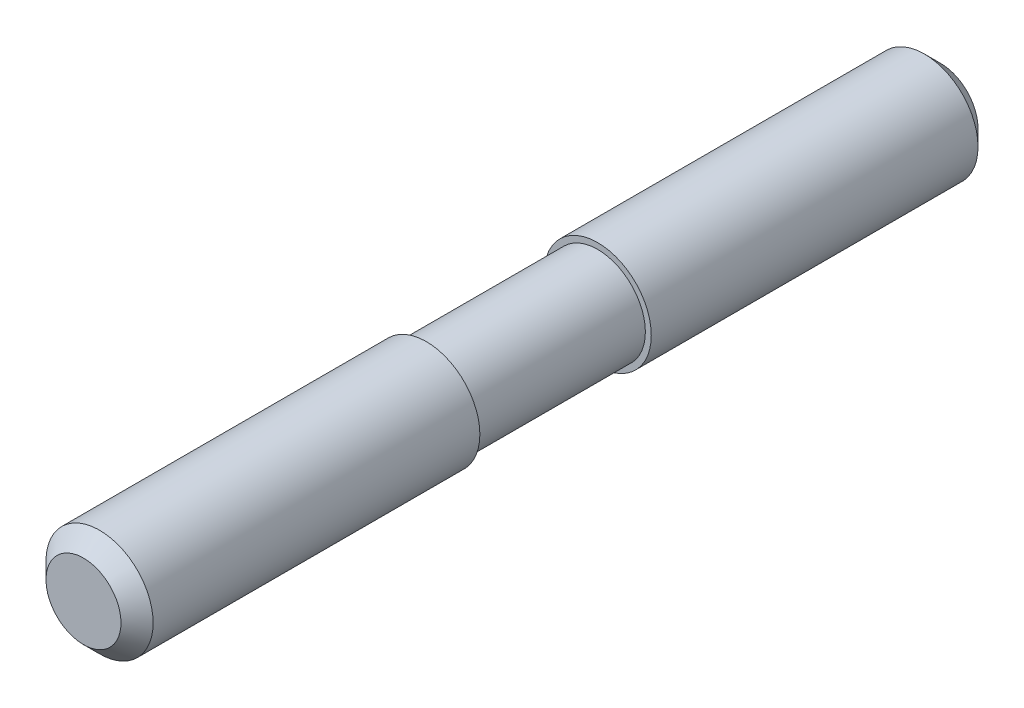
ISO-10303-21;
HEADER;
FILE_DESCRIPTION(('STEP AP214'),'2;1');
FILE_NAME('part.step','',(''),(''),'','','');
FILE_SCHEMA(('AUTOMOTIVE_DESIGN { 1 0 10303 214 1 1 1 1 }'));
ENDSEC;
DATA;
#1=APPLICATION_CONTEXT('core data for automotive mechanical design processes');
#2=APPLICATION_PROTOCOL_DEFINITION('international standard','automotive_design',2000,#1);
#3=PRODUCT_CONTEXT('',#1,'mechanical');
#4=PRODUCT('Part','Part','',(#3));
#5=PRODUCT_RELATED_PRODUCT_CATEGORY('part','',(#4));
#6=PRODUCT_DEFINITION_FORMATION('','',#4);
#7=PRODUCT_DEFINITION_CONTEXT('part definition',#1,'design');
#8=PRODUCT_DEFINITION('design','',#6,#7);
#9=PRODUCT_DEFINITION_SHAPE('','',#8);
#10=(LENGTH_UNIT() NAMED_UNIT(*) SI_UNIT(.MILLI.,.METRE.));
#11=(NAMED_UNIT(*) PLANE_ANGLE_UNIT() SI_UNIT($,.RADIAN.));
#12=(NAMED_UNIT(*) SI_UNIT($,.STERADIAN.) SOLID_ANGLE_UNIT());
#13=UNCERTAINTY_MEASURE_WITH_UNIT(LENGTH_MEASURE(1.E-05),#10,'distance_accuracy_value','');
#14=(GEOMETRIC_REPRESENTATION_CONTEXT(3) GLOBAL_UNCERTAINTY_ASSIGNED_CONTEXT((#13)) GLOBAL_UNIT_ASSIGNED_CONTEXT((#10,
#11,#12)) REPRESENTATION_CONTEXT('',''));
#15=CARTESIAN_POINT('',(0.,0.,0.));
#16=DIRECTION('',(0.,0.,1.));
#17=DIRECTION('',(1.,0.,0.));
#18=AXIS2_PLACEMENT_3D('',#15,#16,#17);
#19=CARTESIAN_POINT('',(0.,0.,0.));
#20=DIRECTION('',(0.,0.,1.));
#21=DIRECTION('',(1.,0.,0.));
#22=AXIS2_PLACEMENT_3D('',#19,#20,#21);
#23=PLANE('',#22);
#24=CARTESIAN_POINT('',(0.,0.,0.));
#25=DIRECTION('',(0.,0.,1.));
#26=DIRECTION('',(1.,0.,0.));
#27=AXIS2_PLACEMENT_3D('',#24,#25,#26);
#28=CIRCLE('',#27,3.5);
#29=CARTESIAN_POINT('',(3.5,0.,0.));
#30=VERTEX_POINT('',#29);
#31=EDGE_CURVE('E8',#30,#30,#28,.T.);
#32=ORIENTED_EDGE('',*,*,#31,.F.);
#33=EDGE_LOOP('',(#32));
#34=FACE_BOUND('',#33,.T.);
#35=ADVANCED_FACE('F12',(#34),#23,.F.);
#36=CARTESIAN_POINT('',(0.,0.,1.5));
#37=DIRECTION('',(0.,0.,1.));
#38=DIRECTION('',(1.,0.,0.));
#39=AXIS2_PLACEMENT_3D('',#36,#37,#38);
#40=CONICAL_SURFACE('',#39,5.,0.785398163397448);
#41=ORIENTED_EDGE('',*,*,#31,.T.);
#42=EDGE_LOOP('',(#41));
#43=FACE_BOUND('',#42,.T.);
#44=CARTESIAN_POINT('',(0.,0.,1.5));
#45=DIRECTION('',(0.,0.,1.));
#46=DIRECTION('',(1.,0.,0.));
#47=AXIS2_PLACEMENT_3D('',#44,#45,#46);
#48=CIRCLE('',#47,5.);
#49=CARTESIAN_POINT('',(5.,0.,1.5));
#50=VERTEX_POINT('',#49);
#51=EDGE_CURVE('E18',#50,#50,#48,.T.);
#52=ORIENTED_EDGE('',*,*,#51,.F.);
#53=EDGE_LOOP('',(#52));
#54=FACE_BOUND('',#53,.T.);
#55=ADVANCED_FACE('F62',(#43,#54),#40,.T.);
#56=CARTESIAN_POINT('',(0.,0.,70.));
#57=DIRECTION('',(0.,0.,1.));
#58=DIRECTION('',(1.,0.,0.));
#59=AXIS2_PLACEMENT_3D('',#56,#57,#58);
#60=CYLINDRICAL_SURFACE('',#59,5.);
#61=CARTESIAN_POINT('',(0.,0.,32.));
#62=DIRECTION('',(0.,0.,1.));
#63=DIRECTION('',(1.,0.,0.));
#64=AXIS2_PLACEMENT_3D('',#61,#62,#63);
#65=CIRCLE('',#64,5.);
#66=CARTESIAN_POINT('',(5.,0.,32.));
#67=VERTEX_POINT('',#66);
#68=EDGE_CURVE('E22',#67,#67,#65,.T.);
#69=ORIENTED_EDGE('',*,*,#68,.F.);
#70=EDGE_LOOP('',(#69));
#71=FACE_BOUND('',#70,.T.);
#72=ORIENTED_EDGE('',*,*,#51,.T.);
#73=EDGE_LOOP('',(#72));
#74=FACE_BOUND('',#73,.T.);
#75=ADVANCED_FACE('F68',(#71,#74),#60,.T.);
#76=CARTESIAN_POINT('',(5.,0.,32.));
#77=DIRECTION('',(0.,0.,-1.));
#78=DIRECTION('',(-1.,0.,0.));
#79=AXIS2_PLACEMENT_3D('',#76,#77,#78);
#80=PLANE('',#79);
#81=CARTESIAN_POINT('',(0.,0.,32.));
#82=DIRECTION('',(0.,0.,1.));
#83=DIRECTION('',(1.,0.,0.));
#84=AXIS2_PLACEMENT_3D('',#81,#82,#83);
#85=CIRCLE('',#84,4.45);
#86=CARTESIAN_POINT('',(4.45,0.,32.));
#87=VERTEX_POINT('',#86);
#88=EDGE_CURVE('E26',#87,#87,#85,.T.);
#89=ORIENTED_EDGE('',*,*,#88,.F.);
#90=EDGE_LOOP('',(#89));
#91=FACE_BOUND('',#90,.T.);
#92=ORIENTED_EDGE('',*,*,#68,.T.);
#93=EDGE_LOOP('',(#92));
#94=FACE_BOUND('',#93,.T.);
#95=ADVANCED_FACE('F73',(#91,#94),#80,.F.);
#96=CARTESIAN_POINT('',(0.,0.,70.));
#97=DIRECTION('',(0.,0.,1.));
#98=DIRECTION('',(1.,0.,0.));
#99=AXIS2_PLACEMENT_3D('',#96,#97,#98);
#100=CYLINDRICAL_SURFACE('',#99,4.45);
#101=CARTESIAN_POINT('',(0.,0.,48.));
#102=DIRECTION('',(0.,0.,1.));
#103=DIRECTION('',(1.,0.,0.));
#104=AXIS2_PLACEMENT_3D('',#101,#102,#103);
#105=CIRCLE('',#104,4.45);
#106=CARTESIAN_POINT('',(4.45,0.,48.));
#107=VERTEX_POINT('',#106);
#108=EDGE_CURVE('E31',#107,#107,#105,.T.);
#109=ORIENTED_EDGE('',*,*,#108,.F.);
#110=EDGE_LOOP('',(#109));
#111=FACE_BOUND('',#110,.T.);
#112=ORIENTED_EDGE('',*,*,#88,.T.);
#113=EDGE_LOOP('',(#112));
#114=FACE_BOUND('',#113,.T.);
#115=ADVANCED_FACE('F80',(#111,#114),#100,.T.);
#116=CARTESIAN_POINT('',(4.45,0.,48.));
#117=DIRECTION('',(0.,0.,1.));
#118=DIRECTION('',(1.,0.,0.));
#119=AXIS2_PLACEMENT_3D('',#116,#117,#118);
#120=PLANE('',#119);
#121=CARTESIAN_POINT('',(0.,0.,48.));
#122=DIRECTION('',(0.,0.,1.));
#123=DIRECTION('',(1.,0.,0.));
#124=AXIS2_PLACEMENT_3D('',#121,#122,#123);
#125=CIRCLE('',#124,5.);
#126=CARTESIAN_POINT('',(5.,0.,48.));
#127=VERTEX_POINT('',#126);
#128=EDGE_CURVE('E34',#127,#127,#125,.T.);
#129=ORIENTED_EDGE('',*,*,#128,.F.);
#130=EDGE_LOOP('',(#129));
#131=FACE_BOUND('',#130,.T.);
#132=ORIENTED_EDGE('',*,*,#108,.T.);
#133=EDGE_LOOP('',(#132));
#134=FACE_BOUND('',#133,.T.);
#135=ADVANCED_FACE('F58',(#131,#134),#120,.F.);
#136=CARTESIAN_POINT('',(0.,0.,70.));
#137=DIRECTION('',(0.,0.,1.));
#138=DIRECTION('',(1.,0.,0.));
#139=AXIS2_PLACEMENT_3D('',#136,#137,#138);
#140=CYLINDRICAL_SURFACE('',#139,5.);
#141=CARTESIAN_POINT('',(0.,0.,78.5));
#142=DIRECTION('',(0.,0.,1.));
#143=DIRECTION('',(1.,0.,0.));
#144=AXIS2_PLACEMENT_3D('',#141,#142,#143);
#145=CIRCLE('',#144,5.);
#146=CARTESIAN_POINT('',(5.,0.,78.5));
#147=VERTEX_POINT('',#146);
#148=EDGE_CURVE('E37',#147,#147,#145,.T.);
#149=ORIENTED_EDGE('',*,*,#148,.F.);
#150=EDGE_LOOP('',(#149));
#151=FACE_BOUND('',#150,.T.);
#152=ORIENTED_EDGE('',*,*,#128,.T.);
#153=EDGE_LOOP('',(#152));
#154=FACE_BOUND('',#153,.T.);
#155=ADVANCED_FACE('F48',(#151,#154),#140,.T.);
#156=CARTESIAN_POINT('',(0.,0.,80.));
#157=DIRECTION('',(0.,0.,-1.));
#158=DIRECTION('',(-1.,0.,0.));
#159=AXIS2_PLACEMENT_3D('',#156,#157,#158);
#160=CONICAL_SURFACE('',#159,3.5,0.785398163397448);
#161=ORIENTED_EDGE('',*,*,#148,.T.);
#162=EDGE_LOOP('',(#161));
#163=FACE_BOUND('',#162,.T.);
#164=CARTESIAN_POINT('',(0.,0.,80.));
#165=DIRECTION('',(0.,0.,1.));
#166=DIRECTION('',(1.,0.,0.));
#167=AXIS2_PLACEMENT_3D('',#164,#165,#166);
#168=CIRCLE('',#167,3.5);
#169=CARTESIAN_POINT('',(3.5,0.,80.));
#170=VERTEX_POINT('',#169);
#171=EDGE_CURVE('E40',#170,#170,#168,.T.);
#172=ORIENTED_EDGE('',*,*,#171,.F.);
#173=EDGE_LOOP('',(#172));
#174=FACE_BOUND('',#173,.T.);
#175=ADVANCED_FACE('F46',(#163,#174),#160,.T.);
#176=CARTESIAN_POINT('',(3.5,0.,80.));
#177=DIRECTION('',(0.,0.,-1.));
#178=DIRECTION('',(-1.,0.,0.));
#179=AXIS2_PLACEMENT_3D('',#176,#177,#178);
#180=PLANE('',#179);
#181=ORIENTED_EDGE('',*,*,#171,.T.);
#182=EDGE_LOOP('',(#181));
#183=FACE_BOUND('',#182,.T.);
#184=ADVANCED_FACE('F44',(#183),#180,.F.);
#185=CLOSED_SHELL('',(#35,#55,#75,#95,#115,#135,#155,#175,#184));
#186=MANIFOLD_SOLID_BREP('B1',#185);
#187=ADVANCED_BREP_SHAPE_REPRESENTATION('',(#18,#186),#14);
#188=SHAPE_DEFINITION_REPRESENTATION(#9,#187);
ENDSEC;
END-ISO-10303-21;
